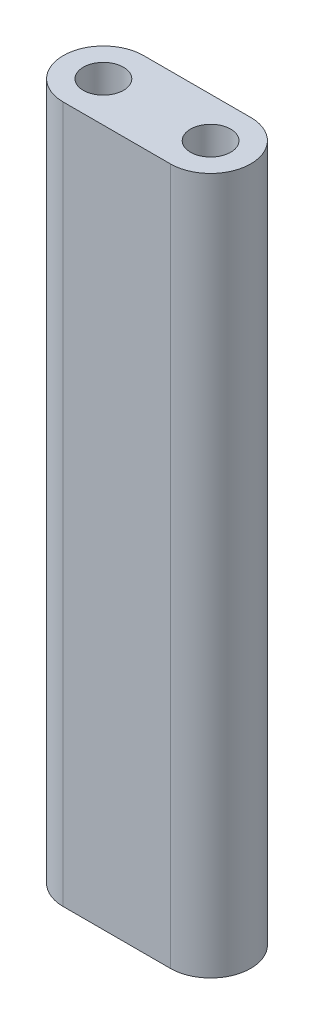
ISO-10303-21;
HEADER;
FILE_DESCRIPTION(('STEP AP214'),'2;1');
FILE_NAME('part.step','',(''),(''),'','','');
FILE_SCHEMA(('AUTOMOTIVE_DESIGN { 1 0 10303 214 1 1 1 1 }'));
ENDSEC;
DATA;
#1=APPLICATION_CONTEXT('core data for automotive mechanical design processes');
#2=APPLICATION_PROTOCOL_DEFINITION('international standard','automotive_design',2000,#1);
#3=PRODUCT_CONTEXT('',#1,'mechanical');
#4=PRODUCT('Part','Part','',(#3));
#5=PRODUCT_RELATED_PRODUCT_CATEGORY('part','',(#4));
#6=PRODUCT_DEFINITION_FORMATION('','',#4);
#7=PRODUCT_DEFINITION_CONTEXT('part definition',#1,'design');
#8=PRODUCT_DEFINITION('design','',#6,#7);
#9=PRODUCT_DEFINITION_SHAPE('','',#8);
#10=(LENGTH_UNIT() NAMED_UNIT(*) SI_UNIT(.MILLI.,.METRE.));
#11=(NAMED_UNIT(*) PLANE_ANGLE_UNIT() SI_UNIT($,.RADIAN.));
#12=(NAMED_UNIT(*) SI_UNIT($,.STERADIAN.) SOLID_ANGLE_UNIT());
#13=UNCERTAINTY_MEASURE_WITH_UNIT(LENGTH_MEASURE(1.E-05),#10,'distance_accuracy_value','');
#14=(GEOMETRIC_REPRESENTATION_CONTEXT(3) GLOBAL_UNCERTAINTY_ASSIGNED_CONTEXT((#13)) GLOBAL_UNIT_ASSIGNED_CONTEXT((#10,
#11,#12)) REPRESENTATION_CONTEXT('',''));
#15=CARTESIAN_POINT('',(0.,0.,0.));
#16=DIRECTION('',(0.,0.,1.));
#17=DIRECTION('',(1.,0.,0.));
#18=AXIS2_PLACEMENT_3D('',#15,#16,#17);
#19=CARTESIAN_POINT('',(-2.76637090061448,52.,0.));
#20=DIRECTION('',(0.,-1.,0.));
#21=DIRECTION('',(0.,0.,-1.));
#22=AXIS2_PLACEMENT_3D('',#19,#20,#21);
#23=CYLINDRICAL_SURFACE('',#22,3.);
#24=CARTESIAN_POINT('',(-2.76637090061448,0.,0.));
#25=DIRECTION('',(0.,1.,0.));
#26=DIRECTION('',(0.,0.,1.));
#27=AXIS2_PLACEMENT_3D('',#24,#25,#26);
#28=CIRCLE('',#27,3.);
#29=CARTESIAN_POINT('',(-2.76637090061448,0.,-3.));
#30=VERTEX_POINT('',#29);
#31=CARTESIAN_POINT('',(-2.76637090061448,0.,3.));
#32=VERTEX_POINT('',#31);
#33=EDGE_CURVE('E104',#30,#32,#28,.T.);
#34=ORIENTED_EDGE('',*,*,#33,.T.);
#35=DIRECTION('',(0.,-1.,0.));
#36=VECTOR('',#35,1.);
#37=CARTESIAN_POINT('',(-2.76637090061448,52.,3.));
#38=LINE('',#37,#36);
#39=CARTESIAN_POINT('',(-2.76637090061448,52.,3.));
#40=VERTEX_POINT('',#39);
#41=EDGE_CURVE('E11',#40,#32,#38,.T.);
#42=ORIENTED_EDGE('',*,*,#41,.F.);
#43=CARTESIAN_POINT('',(-2.76637090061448,52.,0.));
#44=DIRECTION('',(0.,1.,0.));
#45=DIRECTION('',(0.,0.,1.));
#46=AXIS2_PLACEMENT_3D('',#43,#44,#45);
#47=CIRCLE('',#46,3.);
#48=CARTESIAN_POINT('',(-2.76637090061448,52.,-3.));
#49=VERTEX_POINT('',#48);
#50=EDGE_CURVE('E84',#49,#40,#47,.T.);
#51=ORIENTED_EDGE('',*,*,#50,.F.);
#52=DIRECTION('',(0.,-1.,0.));
#53=VECTOR('',#52,1.);
#54=CARTESIAN_POINT('',(-2.76637090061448,52.,-3.));
#55=LINE('',#54,#53);
#56=EDGE_CURVE('E50',#49,#30,#55,.T.);
#57=ORIENTED_EDGE('',*,*,#56,.T.);
#58=EDGE_LOOP('',(#34,#42,#51,#57));
#59=FACE_BOUND('',#58,.T.);
#60=ADVANCED_FACE('F33',(#59),#23,.T.);
#61=CARTESIAN_POINT('',(0.,52.,3.));
#62=DIRECTION('',(0.,0.,-1.));
#63=DIRECTION('',(-1.,0.,0.));
#64=AXIS2_PLACEMENT_3D('',#61,#62,#63);
#65=PLANE('',#64);
#66=DIRECTION('',(1.,0.,0.));
#67=VECTOR('',#66,1.);
#68=CARTESIAN_POINT('',(0.,0.,3.));
#69=LINE('',#68,#67);
#70=CARTESIAN_POINT('',(5.23362909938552,0.,3.));
#71=VERTEX_POINT('',#70);
#72=EDGE_CURVE('E89',#32,#71,#69,.T.);
#73=ORIENTED_EDGE('',*,*,#72,.T.);
#74=DIRECTION('',(0.,-1.,0.));
#75=VECTOR('',#74,1.);
#76=CARTESIAN_POINT('',(5.23362909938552,52.,3.));
#77=LINE('',#76,#75);
#78=CARTESIAN_POINT('',(5.23362909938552,52.,3.));
#79=VERTEX_POINT('',#78);
#80=EDGE_CURVE('E42',#79,#71,#77,.T.);
#81=ORIENTED_EDGE('',*,*,#80,.F.);
#82=DIRECTION('',(1.,0.,0.));
#83=VECTOR('',#82,1.);
#84=CARTESIAN_POINT('',(0.,52.,3.));
#85=LINE('',#84,#83);
#86=EDGE_CURVE('E76',#40,#79,#85,.T.);
#87=ORIENTED_EDGE('',*,*,#86,.F.);
#88=ORIENTED_EDGE('',*,*,#41,.T.);
#89=EDGE_LOOP('',(#73,#81,#87,#88));
#90=FACE_BOUND('',#89,.T.);
#91=ADVANCED_FACE('F88',(#90),#65,.F.);
#92=CARTESIAN_POINT('',(5.23362909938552,52.,0.));
#93=DIRECTION('',(0.,-1.,0.));
#94=DIRECTION('',(0.,0.,-1.));
#95=AXIS2_PLACEMENT_3D('',#92,#93,#94);
#96=CYLINDRICAL_SURFACE('',#95,3.);
#97=CARTESIAN_POINT('',(5.23362909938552,0.,0.));
#98=DIRECTION('',(0.,1.,0.));
#99=DIRECTION('',(0.,0.,1.));
#100=AXIS2_PLACEMENT_3D('',#97,#98,#99);
#101=CIRCLE('',#100,3.);
#102=CARTESIAN_POINT('',(5.23362909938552,0.,-3.));
#103=VERTEX_POINT('',#102);
#104=EDGE_CURVE('E107',#71,#103,#101,.T.);
#105=ORIENTED_EDGE('',*,*,#104,.T.);
#106=DIRECTION('',(0.,-1.,0.));
#107=VECTOR('',#106,1.);
#108=CARTESIAN_POINT('',(5.23362909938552,52.,-3.));
#109=LINE('',#108,#107);
#110=CARTESIAN_POINT('',(5.23362909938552,52.,-3.));
#111=VERTEX_POINT('',#110);
#112=EDGE_CURVE('E65',#111,#103,#109,.T.);
#113=ORIENTED_EDGE('',*,*,#112,.F.);
#114=CARTESIAN_POINT('',(5.23362909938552,52.,0.));
#115=DIRECTION('',(0.,1.,0.));
#116=DIRECTION('',(0.,0.,1.));
#117=AXIS2_PLACEMENT_3D('',#114,#115,#116);
#118=CIRCLE('',#117,3.);
#119=EDGE_CURVE('E83',#79,#111,#118,.T.);
#120=ORIENTED_EDGE('',*,*,#119,.F.);
#121=ORIENTED_EDGE('',*,*,#80,.T.);
#122=EDGE_LOOP('',(#105,#113,#120,#121));
#123=FACE_BOUND('',#122,.T.);
#124=ADVANCED_FACE('F92',(#123),#96,.T.);
#125=CARTESIAN_POINT('',(0.,52.,-3.));
#126=DIRECTION('',(0.,0.,-1.));
#127=DIRECTION('',(-1.,0.,0.));
#128=AXIS2_PLACEMENT_3D('',#125,#126,#127);
#129=PLANE('',#128);
#130=DIRECTION('',(1.,0.,0.));
#131=VECTOR('',#130,1.);
#132=CARTESIAN_POINT('',(0.,0.,-3.));
#133=LINE('',#132,#131);
#134=EDGE_CURVE('E109',#30,#103,#133,.T.);
#135=ORIENTED_EDGE('',*,*,#134,.F.);
#136=ORIENTED_EDGE('',*,*,#56,.F.);
#137=DIRECTION('',(1.,0.,0.));
#138=VECTOR('',#137,1.);
#139=CARTESIAN_POINT('',(0.,52.,-3.));
#140=LINE('',#139,#138);
#141=EDGE_CURVE('E93',#49,#111,#140,.T.);
#142=ORIENTED_EDGE('',*,*,#141,.T.);
#143=ORIENTED_EDGE('',*,*,#112,.T.);
#144=EDGE_LOOP('',(#135,#136,#142,#143));
#145=FACE_BOUND('',#144,.T.);
#146=ADVANCED_FACE('F145',(#145),#129,.T.);
#147=CARTESIAN_POINT('',(-2.76637090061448,52.,0.));
#148=DIRECTION('',(0.,-1.,0.));
#149=DIRECTION('',(0.,0.,-1.));
#150=AXIS2_PLACEMENT_3D('',#147,#148,#149);
#151=CYLINDRICAL_SURFACE('',#150,1.5);
#152=CARTESIAN_POINT('',(-2.76637090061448,52.,0.));
#153=DIRECTION('',(0.,1.,0.));
#154=DIRECTION('',(0.,0.,1.));
#155=AXIS2_PLACEMENT_3D('',#152,#153,#154);
#156=CIRCLE('',#155,1.5);
#157=CARTESIAN_POINT('',(-2.76637090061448,52.,-1.5));
#158=VERTEX_POINT('',#157);
#159=EDGE_CURVE('E115',#158,#158,#156,.T.);
#160=CARTESIAN_POINT('',(-2.76637090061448,0.,0.));
#161=DIRECTION('',(0.,1.,0.));
#162=DIRECTION('',(0.,0.,1.));
#163=AXIS2_PLACEMENT_3D('',#160,#161,#162);
#164=CIRCLE('',#163,1.5);
#165=CARTESIAN_POINT('',(-2.76637090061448,0.,-1.5));
#166=VERTEX_POINT('',#165);
#167=EDGE_CURVE('E101',#166,#166,#164,.T.);
#168=CARTESIAN_POINT('',(-2.76637090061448,52.,-1.5));
#169=CARTESIAN_POINT('',(-2.76637090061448,51.4583333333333,-1.5));
#170=CARTESIAN_POINT('',(-2.76637090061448,50.9166666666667,-1.5));
#171=CARTESIAN_POINT('',(-2.76637090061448,49.8333333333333,-1.5));
#172=CARTESIAN_POINT('',(-2.76637090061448,49.2916666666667,-1.5));
#173=CARTESIAN_POINT('',(-2.76637090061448,48.2083333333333,-1.5));
#174=CARTESIAN_POINT('',(-2.76637090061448,47.6666666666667,-1.5));
#175=CARTESIAN_POINT('',(-2.76637090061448,46.5833333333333,-1.5));
#176=CARTESIAN_POINT('',(-2.76637090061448,46.0416666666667,-1.5));
#177=CARTESIAN_POINT('',(-2.76637090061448,44.9583333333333,-1.5));
#178=CARTESIAN_POINT('',(-2.76637090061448,44.4166666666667,-1.5));
#179=CARTESIAN_POINT('',(-2.76637090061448,43.3333333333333,-1.5));
#180=CARTESIAN_POINT('',(-2.76637090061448,42.7916666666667,-1.5));
#181=CARTESIAN_POINT('',(-2.76637090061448,41.7083333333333,-1.5));
#182=CARTESIAN_POINT('',(-2.76637090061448,41.1666666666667,-1.5));
#183=CARTESIAN_POINT('',(-2.76637090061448,40.0833333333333,-1.5));
#184=CARTESIAN_POINT('',(-2.76637090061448,39.5416666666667,-1.5));
#185=CARTESIAN_POINT('',(-2.76637090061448,38.4583333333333,-1.5));
#186=CARTESIAN_POINT('',(-2.76637090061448,37.9166666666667,-1.5));
#187=CARTESIAN_POINT('',(-2.76637090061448,36.8333333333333,-1.5));
#188=CARTESIAN_POINT('',(-2.76637090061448,36.2916666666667,-1.5));
#189=CARTESIAN_POINT('',(-2.76637090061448,35.2083333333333,-1.5));
#190=CARTESIAN_POINT('',(-2.76637090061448,34.6666666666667,-1.5));
#191=CARTESIAN_POINT('',(-2.76637090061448,33.5833333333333,-1.5));
#192=CARTESIAN_POINT('',(-2.76637090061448,33.0416666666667,-1.5));
#193=CARTESIAN_POINT('',(-2.76637090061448,31.9583333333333,-1.5));
#194=CARTESIAN_POINT('',(-2.76637090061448,31.4166666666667,-1.5));
#195=CARTESIAN_POINT('',(-2.76637090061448,30.3333333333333,-1.5));
#196=CARTESIAN_POINT('',(-2.76637090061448,29.7916666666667,-1.5));
#197=CARTESIAN_POINT('',(-2.76637090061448,28.7083333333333,-1.5));
#198=CARTESIAN_POINT('',(-2.76637090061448,28.1666666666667,-1.5));
#199=CARTESIAN_POINT('',(-2.76637090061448,27.0833333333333,-1.5));
#200=CARTESIAN_POINT('',(-2.76637090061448,26.5416666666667,-1.5));
#201=CARTESIAN_POINT('',(-2.76637090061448,25.4583333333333,-1.5));
#202=CARTESIAN_POINT('',(-2.76637090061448,24.9166666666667,-1.5));
#203=CARTESIAN_POINT('',(-2.76637090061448,23.8333333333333,-1.5));
#204=CARTESIAN_POINT('',(-2.76637090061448,23.2916666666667,-1.5));
#205=CARTESIAN_POINT('',(-2.76637090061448,22.2083333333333,-1.5));
#206=CARTESIAN_POINT('',(-2.76637090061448,21.6666666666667,-1.5));
#207=CARTESIAN_POINT('',(-2.76637090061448,20.5833333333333,-1.5));
#208=CARTESIAN_POINT('',(-2.76637090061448,20.0416666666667,-1.5));
#209=CARTESIAN_POINT('',(-2.76637090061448,18.9583333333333,-1.5));
#210=CARTESIAN_POINT('',(-2.76637090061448,18.4166666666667,-1.5));
#211=CARTESIAN_POINT('',(-2.76637090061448,17.3333333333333,-1.5));
#212=CARTESIAN_POINT('',(-2.76637090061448,16.7916666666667,-1.5));
#213=CARTESIAN_POINT('',(-2.76637090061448,15.7083333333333,-1.5));
#214=CARTESIAN_POINT('',(-2.76637090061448,15.1666666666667,-1.5));
#215=CARTESIAN_POINT('',(-2.76637090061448,14.0833333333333,-1.5));
#216=CARTESIAN_POINT('',(-2.76637090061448,13.5416666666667,-1.5));
#217=CARTESIAN_POINT('',(-2.76637090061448,12.4583333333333,-1.5));
#218=CARTESIAN_POINT('',(-2.76637090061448,11.9166666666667,-1.5));
#219=CARTESIAN_POINT('',(-2.76637090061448,10.8333333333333,-1.5));
#220=CARTESIAN_POINT('',(-2.76637090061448,10.2916666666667,-1.5));
#221=CARTESIAN_POINT('',(-2.76637090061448,9.20833333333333,-1.5));
#222=CARTESIAN_POINT('',(-2.76637090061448,8.66666666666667,-1.5));
#223=CARTESIAN_POINT('',(-2.76637090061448,7.58333333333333,-1.5));
#224=CARTESIAN_POINT('',(-2.76637090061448,7.04166666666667,-1.5));
#225=CARTESIAN_POINT('',(-2.76637090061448,5.95833333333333,-1.5));
#226=CARTESIAN_POINT('',(-2.76637090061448,5.41666666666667,-1.5));
#227=CARTESIAN_POINT('',(-2.76637090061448,4.33333333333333,-1.5));
#228=CARTESIAN_POINT('',(-2.76637090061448,3.79166666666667,-1.5));
#229=CARTESIAN_POINT('',(-2.76637090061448,2.70833333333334,-1.5));
#230=CARTESIAN_POINT('',(-2.76637090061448,2.16666666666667,-1.5));
#231=CARTESIAN_POINT('',(-2.76637090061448,1.08333333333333,-1.5));
#232=CARTESIAN_POINT('',(-2.76637090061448,0.541666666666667,-1.5));
#233=CARTESIAN_POINT('',(-2.76637090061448,0.,-1.5));
#234=B_SPLINE_CURVE_WITH_KNOTS('',3,(#168,#169,#170,#171,#172,#173,#174,#175,#176,#177,#178,
#179,#180,#181,#182,#183,#184,#185,#186,#187,#188,#189,#190,#191,#192,#193,#194,#195,#196,#197,
#198,#199,#200,#201,#202,#203,#204,#205,#206,#207,#208,#209,#210,#211,#212,#213,#214,#215,#216,
#217,#218,#219,#220,#221,#222,#223,#224,#225,#226,#227,#228,#229,#230,#231,#232,#233),
.UNSPECIFIED.,.F.,.F.,(4,2,2,2,2,2,2,2,2,2,2,2,2,2,2,2,2,2,2,2,2,2,2,2,2,2,2,2,2,2,2,2,4),(0.,
1.62499999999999,3.25,4.875,6.49999999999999,8.12499999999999,9.74999999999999,11.375,13.,
14.625,16.25,17.875,19.5,21.125,22.75,24.375,26.,27.625,29.25,30.875,32.5,34.125,35.75,37.375,
39.,40.625,42.25,43.875,45.5,47.125,48.75,50.375,52.),.UNSPECIFIED.);
#235=EDGE_CURVE('BSEAM35',#158,#166,#234,.T.);
#236=ORIENTED_EDGE('',*,*,#159,.T.);
#237=ORIENTED_EDGE('',*,*,#167,.F.);
#238=ORIENTED_EDGE('',*,*,#235,.T.);
#239=ORIENTED_EDGE('',*,*,#235,.F.);
#240=EDGE_LOOP('',(#236,#238,#237,#239));
#241=FACE_BOUND('',#240,.T.);
#242=ADVANCED_FACE('F35',(#241),#151,.F.);
#243=CARTESIAN_POINT('',(5.23362909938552,52.,0.));
#244=DIRECTION('',(0.,-1.,0.));
#245=DIRECTION('',(0.,0.,-1.));
#246=AXIS2_PLACEMENT_3D('',#243,#244,#245);
#247=CYLINDRICAL_SURFACE('',#246,1.5);
#248=CARTESIAN_POINT('',(5.23362909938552,52.,0.));
#249=DIRECTION('',(0.,1.,0.));
#250=DIRECTION('',(0.,0.,1.));
#251=AXIS2_PLACEMENT_3D('',#248,#249,#250);
#252=CIRCLE('',#251,1.5);
#253=CARTESIAN_POINT('',(5.23362909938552,52.,-1.5));
#254=VERTEX_POINT('',#253);
#255=EDGE_CURVE('E95',#254,#254,#252,.T.);
#256=CARTESIAN_POINT('',(5.23362909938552,0.,0.));
#257=DIRECTION('',(0.,1.,0.));
#258=DIRECTION('',(0.,0.,1.));
#259=AXIS2_PLACEMENT_3D('',#256,#257,#258);
#260=CIRCLE('',#259,1.5);
#261=CARTESIAN_POINT('',(5.23362909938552,0.,-1.5));
#262=VERTEX_POINT('',#261);
#263=EDGE_CURVE('E112',#262,#262,#260,.T.);
#264=CARTESIAN_POINT('',(5.23362909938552,52.,-1.5));
#265=CARTESIAN_POINT('',(5.23362909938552,51.4583333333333,-1.5));
#266=CARTESIAN_POINT('',(5.23362909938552,50.9166666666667,-1.5));
#267=CARTESIAN_POINT('',(5.23362909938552,49.8333333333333,-1.5));
#268=CARTESIAN_POINT('',(5.23362909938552,49.2916666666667,-1.5));
#269=CARTESIAN_POINT('',(5.23362909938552,48.2083333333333,-1.5));
#270=CARTESIAN_POINT('',(5.23362909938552,47.6666666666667,-1.5));
#271=CARTESIAN_POINT('',(5.23362909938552,46.5833333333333,-1.5));
#272=CARTESIAN_POINT('',(5.23362909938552,46.0416666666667,-1.5));
#273=CARTESIAN_POINT('',(5.23362909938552,44.9583333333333,-1.5));
#274=CARTESIAN_POINT('',(5.23362909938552,44.4166666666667,-1.5));
#275=CARTESIAN_POINT('',(5.23362909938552,43.3333333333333,-1.5));
#276=CARTESIAN_POINT('',(5.23362909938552,42.7916666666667,-1.5));
#277=CARTESIAN_POINT('',(5.23362909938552,41.7083333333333,-1.5));
#278=CARTESIAN_POINT('',(5.23362909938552,41.1666666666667,-1.5));
#279=CARTESIAN_POINT('',(5.23362909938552,40.0833333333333,-1.5));
#280=CARTESIAN_POINT('',(5.23362909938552,39.5416666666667,-1.5));
#281=CARTESIAN_POINT('',(5.23362909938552,38.4583333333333,-1.5));
#282=CARTESIAN_POINT('',(5.23362909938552,37.9166666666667,-1.5));
#283=CARTESIAN_POINT('',(5.23362909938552,36.8333333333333,-1.5));
#284=CARTESIAN_POINT('',(5.23362909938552,36.2916666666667,-1.5));
#285=CARTESIAN_POINT('',(5.23362909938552,35.2083333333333,-1.5));
#286=CARTESIAN_POINT('',(5.23362909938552,34.6666666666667,-1.5));
#287=CARTESIAN_POINT('',(5.23362909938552,33.5833333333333,-1.5));
#288=CARTESIAN_POINT('',(5.23362909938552,33.0416666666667,-1.5));
#289=CARTESIAN_POINT('',(5.23362909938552,31.9583333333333,-1.5));
#290=CARTESIAN_POINT('',(5.23362909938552,31.4166666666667,-1.5));
#291=CARTESIAN_POINT('',(5.23362909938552,30.3333333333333,-1.5));
#292=CARTESIAN_POINT('',(5.23362909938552,29.7916666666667,-1.5));
#293=CARTESIAN_POINT('',(5.23362909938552,28.7083333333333,-1.5));
#294=CARTESIAN_POINT('',(5.23362909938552,28.1666666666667,-1.5));
#295=CARTESIAN_POINT('',(5.23362909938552,27.0833333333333,-1.5));
#296=CARTESIAN_POINT('',(5.23362909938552,26.5416666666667,-1.5));
#297=CARTESIAN_POINT('',(5.23362909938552,25.4583333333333,-1.5));
#298=CARTESIAN_POINT('',(5.23362909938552,24.9166666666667,-1.5));
#299=CARTESIAN_POINT('',(5.23362909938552,23.8333333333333,-1.5));
#300=CARTESIAN_POINT('',(5.23362909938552,23.2916666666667,-1.5));
#301=CARTESIAN_POINT('',(5.23362909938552,22.2083333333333,-1.5));
#302=CARTESIAN_POINT('',(5.23362909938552,21.6666666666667,-1.5));
#303=CARTESIAN_POINT('',(5.23362909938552,20.5833333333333,-1.5));
#304=CARTESIAN_POINT('',(5.23362909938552,20.0416666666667,-1.5));
#305=CARTESIAN_POINT('',(5.23362909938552,18.9583333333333,-1.5));
#306=CARTESIAN_POINT('',(5.23362909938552,18.4166666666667,-1.5));
#307=CARTESIAN_POINT('',(5.23362909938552,17.3333333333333,-1.5));
#308=CARTESIAN_POINT('',(5.23362909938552,16.7916666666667,-1.5));
#309=CARTESIAN_POINT('',(5.23362909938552,15.7083333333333,-1.5));
#310=CARTESIAN_POINT('',(5.23362909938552,15.1666666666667,-1.5));
#311=CARTESIAN_POINT('',(5.23362909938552,14.0833333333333,-1.5));
#312=CARTESIAN_POINT('',(5.23362909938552,13.5416666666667,-1.5));
#313=CARTESIAN_POINT('',(5.23362909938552,12.4583333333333,-1.5));
#314=CARTESIAN_POINT('',(5.23362909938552,11.9166666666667,-1.5));
#315=CARTESIAN_POINT('',(5.23362909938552,10.8333333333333,-1.5));
#316=CARTESIAN_POINT('',(5.23362909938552,10.2916666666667,-1.5));
#317=CARTESIAN_POINT('',(5.23362909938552,9.20833333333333,-1.5));
#318=CARTESIAN_POINT('',(5.23362909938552,8.66666666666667,-1.5));
#319=CARTESIAN_POINT('',(5.23362909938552,7.58333333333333,-1.5));
#320=CARTESIAN_POINT('',(5.23362909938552,7.04166666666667,-1.5));
#321=CARTESIAN_POINT('',(5.23362909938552,5.95833333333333,-1.5));
#322=CARTESIAN_POINT('',(5.23362909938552,5.41666666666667,-1.5));
#323=CARTESIAN_POINT('',(5.23362909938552,4.33333333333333,-1.5));
#324=CARTESIAN_POINT('',(5.23362909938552,3.79166666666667,-1.5));
#325=CARTESIAN_POINT('',(5.23362909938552,2.70833333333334,-1.5));
#326=CARTESIAN_POINT('',(5.23362909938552,2.16666666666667,-1.5));
#327=CARTESIAN_POINT('',(5.23362909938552,1.08333333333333,-1.5));
#328=CARTESIAN_POINT('',(5.23362909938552,0.541666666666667,-1.5));
#329=CARTESIAN_POINT('',(5.23362909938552,0.,-1.5));
#330=B_SPLINE_CURVE_WITH_KNOTS('',3,(#264,#265,#266,#267,#268,#269,#270,#271,#272,#273,#274,
#275,#276,#277,#278,#279,#280,#281,#282,#283,#284,#285,#286,#287,#288,#289,#290,#291,#292,#293,
#294,#295,#296,#297,#298,#299,#300,#301,#302,#303,#304,#305,#306,#307,#308,#309,#310,#311,#312,
#313,#314,#315,#316,#317,#318,#319,#320,#321,#322,#323,#324,#325,#326,#327,#328,#329),
.UNSPECIFIED.,.F.,.F.,(4,2,2,2,2,2,2,2,2,2,2,2,2,2,2,2,2,2,2,2,2,2,2,2,2,2,2,2,2,2,2,2,4),(0.,
1.62499999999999,3.25,4.875,6.49999999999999,8.12499999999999,9.74999999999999,11.375,13.,
14.625,16.25,17.875,19.5,21.125,22.75,24.375,26.,27.625,29.25,30.875,32.5,34.125,35.75,37.375,
39.,40.625,42.25,43.875,45.5,47.125,48.75,50.375,52.),.UNSPECIFIED.);
#331=EDGE_CURVE('BSEAM127',#254,#262,#330,.T.);
#332=ORIENTED_EDGE('',*,*,#255,.T.);
#333=ORIENTED_EDGE('',*,*,#263,.F.);
#334=ORIENTED_EDGE('',*,*,#331,.T.);
#335=ORIENTED_EDGE('',*,*,#331,.F.);
#336=EDGE_LOOP('',(#332,#334,#333,#335));
#337=FACE_BOUND('',#336,.T.);
#338=ADVANCED_FACE('F127',(#337),#247,.F.);
#339=CARTESIAN_POINT('',(0.,52.,0.));
#340=DIRECTION('',(0.,1.,0.));
#341=DIRECTION('',(0.,0.,1.));
#342=AXIS2_PLACEMENT_3D('',#339,#340,#341);
#343=PLANE('',#342);
#344=ORIENTED_EDGE('',*,*,#159,.F.);
#345=EDGE_LOOP('',(#344));
#346=FACE_BOUND('',#345,.T.);
#347=ORIENTED_EDGE('',*,*,#50,.T.);
#348=ORIENTED_EDGE('',*,*,#86,.T.);
#349=ORIENTED_EDGE('',*,*,#119,.T.);
#350=ORIENTED_EDGE('',*,*,#141,.F.);
#351=EDGE_LOOP('',(#347,#348,#349,#350));
#352=FACE_BOUND('',#351,.T.);
#353=ORIENTED_EDGE('',*,*,#255,.F.);
#354=EDGE_LOOP('',(#353));
#355=FACE_BOUND('',#354,.T.);
#356=ADVANCED_FACE('F79',(#346,#352,#355),#343,.T.);
#357=CARTESIAN_POINT('',(0.,0.,0.));
#358=DIRECTION('',(0.,1.,0.));
#359=DIRECTION('',(0.,0.,1.));
#360=AXIS2_PLACEMENT_3D('',#357,#358,#359);
#361=PLANE('',#360);
#362=ORIENTED_EDGE('',*,*,#167,.T.);
#363=EDGE_LOOP('',(#362));
#364=FACE_BOUND('',#363,.T.);
#365=ORIENTED_EDGE('',*,*,#33,.F.);
#366=ORIENTED_EDGE('',*,*,#134,.T.);
#367=ORIENTED_EDGE('',*,*,#104,.F.);
#368=ORIENTED_EDGE('',*,*,#72,.F.);
#369=EDGE_LOOP('',(#365,#366,#367,#368));
#370=FACE_BOUND('',#369,.T.);
#371=ORIENTED_EDGE('',*,*,#263,.T.);
#372=EDGE_LOOP('',(#371));
#373=FACE_BOUND('',#372,.T.);
#374=ADVANCED_FACE('F126',(#364,#370,#373),#361,.F.);
#375=CLOSED_SHELL('',(#60,#91,#124,#146,#242,#338,#356,#374));
#376=MANIFOLD_SOLID_BREP('B2',#375);
#377=ADVANCED_BREP_SHAPE_REPRESENTATION('',(#18,#376),#14);
#378=SHAPE_DEFINITION_REPRESENTATION(#9,#377);
ENDSEC;
END-ISO-10303-21;
